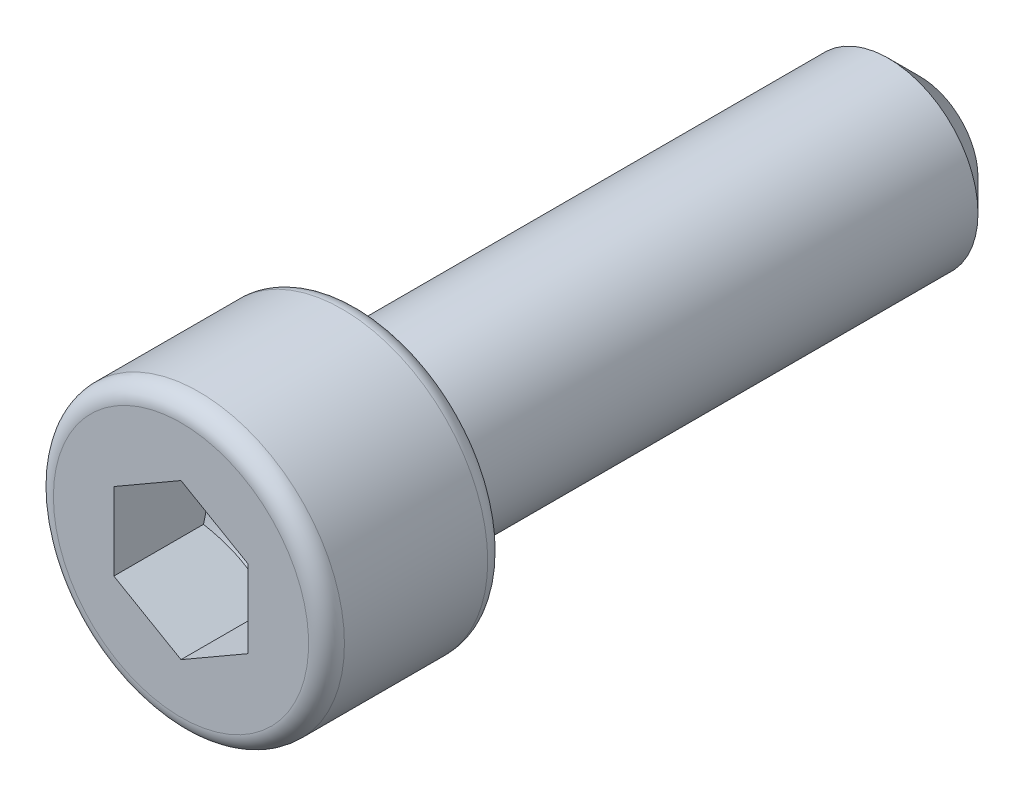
ISO-10303-21;
HEADER;
FILE_DESCRIPTION(('STEP AP214'),'2;1');
FILE_NAME('part.step','',(''),(''),'','','');
FILE_SCHEMA(('AUTOMOTIVE_DESIGN { 1 0 10303 214 1 1 1 1 }'));
ENDSEC;
DATA;
#1=APPLICATION_CONTEXT('core data for automotive mechanical design processes');
#2=APPLICATION_PROTOCOL_DEFINITION('international standard','automotive_design',2000,#1);
#3=PRODUCT_CONTEXT('',#1,'mechanical');
#4=PRODUCT('Part','Part','',(#3));
#5=PRODUCT_RELATED_PRODUCT_CATEGORY('part','',(#4));
#6=PRODUCT_DEFINITION_FORMATION('','',#4);
#7=PRODUCT_DEFINITION_CONTEXT('part definition',#1,'design');
#8=PRODUCT_DEFINITION('design','',#6,#7);
#9=PRODUCT_DEFINITION_SHAPE('','',#8);
#10=(LENGTH_UNIT() NAMED_UNIT(*) SI_UNIT(.MILLI.,.METRE.));
#11=(NAMED_UNIT(*) PLANE_ANGLE_UNIT() SI_UNIT($,.RADIAN.));
#12=(NAMED_UNIT(*) SI_UNIT($,.STERADIAN.) SOLID_ANGLE_UNIT());
#13=UNCERTAINTY_MEASURE_WITH_UNIT(LENGTH_MEASURE(1.E-05),#10,'distance_accuracy_value','');
#14=(GEOMETRIC_REPRESENTATION_CONTEXT(3) GLOBAL_UNCERTAINTY_ASSIGNED_CONTEXT((#13)) GLOBAL_UNIT_ASSIGNED_CONTEXT((#10,
#11,#12)) REPRESENTATION_CONTEXT('',''));
#15=CARTESIAN_POINT('',(0.,0.,0.));
#16=DIRECTION('',(0.,0.,1.));
#17=DIRECTION('',(1.,0.,0.));
#18=AXIS2_PLACEMENT_3D('',#15,#16,#17);
#19=CARTESIAN_POINT('',(3.,1.73205080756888,-4.));
#20=DIRECTION('',(0.5,0.866025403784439,0.));
#21=DIRECTION('',(-0.866025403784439,0.5,0.));
#22=AXIS2_PLACEMENT_3D('',#19,#20,#21);
#23=PLANE('',#22);
#24=CARTESIAN_POINT('',(3.0002,1.73193533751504,-4.00166444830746));
#25=CARTESIAN_POINT('',(2.86836479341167,1.80805042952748,-4.04562660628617));
#26=CARTESIAN_POINT('',(2.73539159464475,1.88482254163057,-4.08560872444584));
#27=CARTESIAN_POINT('',(2.46714257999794,2.03969618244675,-4.15539823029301));
#28=CARTESIAN_POINT('',(2.33186199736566,2.11780046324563,-4.18518092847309));
#29=CARTESIAN_POINT('',(2.06297739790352,2.27304105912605,-4.23154247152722));
#30=CARTESIAN_POINT('',(1.92941475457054,2.35015348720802,-4.24842986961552));
#31=CARTESIAN_POINT('',(1.66166094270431,2.50474122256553,-4.26859066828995));
#32=CARTESIAN_POINT('',(1.52747074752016,2.58221596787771,-4.27188076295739));
#33=CARTESIAN_POINT('',(1.27672440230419,2.72698443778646,-4.26503977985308));
#34=CARTESIAN_POINT('',(1.16013073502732,2.79429982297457,-4.25658839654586));
#35=CARTESIAN_POINT('',(0.927703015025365,2.92849202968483,-4.22980136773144));
#36=CARTESIAN_POINT('',(0.81186976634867,2.99536838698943,-4.21145656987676));
#37=CARTESIAN_POINT('',(0.578962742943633,3.12983731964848,-4.16559555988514));
#38=CARTESIAN_POINT('',(0.46191844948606,3.19741287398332,-4.13788492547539));
#39=CARTESIAN_POINT('',(0.229575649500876,3.33155605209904,-4.07499251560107));
#40=CARTESIAN_POINT('',(0.114274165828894,3.39812539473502,-4.03982551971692));
#41=CARTESIAN_POINT('',(-0.000199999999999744,3.46421708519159,-4.00166444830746));
#42=B_SPLINE_CURVE_WITH_KNOTS('',3,(#24,#25,#26,#27,#28,#29,#30,#31,#32,#33,#34,#35,#36,#37,#38,
#39,#40,#41),.UNSPECIFIED.,.F.,.F.,(4,2,2,2,2,2,2,2,4),(0.,0.475539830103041,0.952222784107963,
1.41710776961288,1.88142182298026,2.28572436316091,2.69040156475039,3.10405572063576,
3.5168974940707),.UNSPECIFIED.);
#43=CARTESIAN_POINT('',(3.,1.73205080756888,-4.00173111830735));
#44=VERTEX_POINT('',#43);
#45=CARTESIAN_POINT('',(0.,3.46410161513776,-4.00173111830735));
#46=VERTEX_POINT('',#45);
#47=EDGE_CURVE('E102',#44,#46,#42,.T.);
#48=ORIENTED_EDGE('',*,*,#47,.F.);
#49=DIRECTION('',(0.,0.,1.));
#50=VECTOR('',#49,1.);
#51=CARTESIAN_POINT('',(3.,1.73205080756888,-4.));
#52=LINE('',#51,#50);
#53=CARTESIAN_POINT('',(3.,1.73205080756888,0.));
#54=VERTEX_POINT('',#53);
#55=EDGE_CURVE('E267',#44,#54,#52,.T.);
#56=ORIENTED_EDGE('',*,*,#55,.T.);
#57=DIRECTION('',(-0.866025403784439,0.5,0.));
#58=VECTOR('',#57,1.);
#59=CARTESIAN_POINT('',(3.,1.73205080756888,0.));
#60=LINE('',#59,#58);
#61=CARTESIAN_POINT('',(0.,3.46410161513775,0.));
#62=VERTEX_POINT('',#61);
#63=EDGE_CURVE('E153',#54,#62,#60,.T.);
#64=ORIENTED_EDGE('',*,*,#63,.T.);
#65=DIRECTION('',(0.,0.,1.));
#66=VECTOR('',#65,1.);
#67=CARTESIAN_POINT('',(0.,3.46410161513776,-4.));
#68=LINE('',#67,#66);
#69=EDGE_CURVE('E273',#46,#62,#68,.T.);
#70=ORIENTED_EDGE('',*,*,#69,.F.);
#71=EDGE_LOOP('',(#48,#56,#64,#70));
#72=FACE_BOUND('',#71,.T.);
#73=ADVANCED_FACE('F87',(#72),#23,.F.);
#74=CARTESIAN_POINT('',(3.,-1.73205080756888,-4.));
#75=DIRECTION('',(1.,0.,0.));
#76=DIRECTION('',(0.,0.,-1.));
#77=AXIS2_PLACEMENT_3D('',#74,#75,#76);
#78=PLANE('',#77);
#79=CARTESIAN_POINT('',(3.,-4.48620013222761,-2.88585822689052));
#80=CARTESIAN_POINT('',(3.,-4.3566315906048,-2.94802358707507));
#81=CARTESIAN_POINT('',(3.,-4.22674746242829,-3.00954343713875));
#82=CARTESIAN_POINT('',(3.,-3.96617981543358,-3.13092589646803));
#83=CARTESIAN_POINT('',(3.,-3.83549615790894,-3.19078820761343));
#84=CARTESIAN_POINT('',(3.,-3.57241191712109,-3.30882380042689));
#85=CARTESIAN_POINT('',(3.,-3.44000572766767,-3.36698463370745));
#86=CARTESIAN_POINT('',(3.,-3.17408239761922,-3.48069891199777));
#87=CARTESIAN_POINT('',(3.,-3.04056531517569,-3.53625249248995));
#88=CARTESIAN_POINT('',(3.,-2.76868835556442,-3.64547348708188));
#89=CARTESIAN_POINT('',(3.,-2.63029316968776,-3.69905352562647));
#90=CARTESIAN_POINT('',(3.,-2.35182880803,-3.8017598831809));
#91=CARTESIAN_POINT('',(3.,-2.2117594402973,-3.85088568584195));
#92=CARTESIAN_POINT('',(3.,-1.93004107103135,-3.94328082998));
#93=CARTESIAN_POINT('',(3.,-1.78839647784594,-3.98656346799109));
#94=CARTESIAN_POINT('',(3.,-1.50308947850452,-4.06578585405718));
#95=CARTESIAN_POINT('',(3.,-1.35942776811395,-4.10172807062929));
#96=CARTESIAN_POINT('',(3.,-1.07038630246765,-4.16435557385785));
#97=CARTESIAN_POINT('',(3.,-0.925010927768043,-4.19106068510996));
#98=CARTESIAN_POINT('',(3.,-0.632633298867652,-4.2334698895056));
#99=CARTESIAN_POINT('',(3.,-0.485631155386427,-4.24917472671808));
#100=CARTESIAN_POINT('',(3.,-0.192575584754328,-4.26812625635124));
#101=CARTESIAN_POINT('',(3.,-0.046531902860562,-4.27152000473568));
#102=CARTESIAN_POINT('',(3.,0.245327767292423,-4.26593974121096));
#103=CARTESIAN_POINT('',(3.,0.391143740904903,-4.2569649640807));
#104=CARTESIAN_POINT('',(3.,0.643627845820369,-4.23132100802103));
#105=CARTESIAN_POINT('',(3.,0.750575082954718,-4.21727322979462));
#106=CARTESIAN_POINT('',(3.,0.963574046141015,-4.18349060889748));
#107=CARTESIAN_POINT('',(3.,1.06962562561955,-4.1637548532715));
#108=CARTESIAN_POINT('',(3.,1.38635461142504,-4.0970655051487));
#109=CARTESIAN_POINT('',(3.,1.59547137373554,-4.04264522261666));
#110=CARTESIAN_POINT('',(3.,1.90813887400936,-3.94967638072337));
#111=CARTESIAN_POINT('',(3.,2.01333803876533,-3.91636793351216));
#112=CARTESIAN_POINT('',(3.,2.22271330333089,-3.84664892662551));
#113=CARTESIAN_POINT('',(3.,2.32688939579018,-3.81023834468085));
#114=CARTESIAN_POINT('',(3.,2.53426014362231,-3.73486938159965));
#115=CARTESIAN_POINT('',(3.,2.63745517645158,-3.69591202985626));
#116=CARTESIAN_POINT('',(3.,2.84301340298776,-3.61587190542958));
#117=CARTESIAN_POINT('',(3.,2.94537661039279,-3.57478916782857));
#118=CARTESIAN_POINT('',(3.,3.20670848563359,-3.46727166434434));
#119=CARTESIAN_POINT('',(3.,3.36515381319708,-3.39956650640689));
#120=CARTESIAN_POINT('',(3.,3.68061655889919,-3.26089781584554));
#121=CARTESIAN_POINT('',(3.,3.83763386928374,-3.18993403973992));
#122=CARTESIAN_POINT('',(3.,4.15054605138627,-3.04548351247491));
#123=CARTESIAN_POINT('',(3.,4.30644064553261,-2.97199616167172));
#124=CARTESIAN_POINT('',(3.,4.6172907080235,-2.8230583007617));
#125=CARTESIAN_POINT('',(3.,4.77224615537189,-2.74760774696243));
#126=CARTESIAN_POINT('',(3.,5.23633561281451,-2.51876716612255));
#127=CARTESIAN_POINT('',(3.,5.54432599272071,-2.36306005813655));
#128=CARTESIAN_POINT('',(3.,6.15819238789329,-2.04766581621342));
#129=CARTESIAN_POINT('',(3.,6.46406870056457,-1.88797925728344));
#130=CARTESIAN_POINT('',(3.,7.04555187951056,-1.58104870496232));
#131=CARTESIAN_POINT('',(3.,7.32129017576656,-1.43405330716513));
#132=CARTESIAN_POINT('',(3.,7.87188136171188,-1.13838810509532));
#133=CARTESIAN_POINT('',(3.,8.14673421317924,-0.989718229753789));
#134=CARTESIAN_POINT('',(3.,8.69505790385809,-0.691503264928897));
#135=CARTESIAN_POINT('',(3.,8.96853048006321,-0.541961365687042));
#136=CARTESIAN_POINT('',(3.,9.51492125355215,-0.241905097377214));
#137=CARTESIAN_POINT('',(3.,9.78783948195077,-0.0913907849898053));
#138=CARTESIAN_POINT('',(3.,10.0605590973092,0.0594802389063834));
#139=B_SPLINE_CURVE_WITH_KNOTS('',3,(#79,#80,#81,#82,#83,#84,#85,#86,#87,#88,#89,#90,#91,#92,
#93,#94,#95,#96,#97,#98,#99,#100,#101,#102,#103,#104,#105,#106,#107,#108,#109,#110,#111,#112,
#113,#114,#115,#116,#117,#118,#119,#120,#121,#122,#123,#124,#125,#126,#127,#128,#129,#130,#131,
#132,#133,#134,#135,#136,#137,#138),.UNSPECIFIED.,.F.,.F.,(4,2,2,2,2,2,2,2,2,2,2,2,2,2,2,2,2,2,
2,2,2,2,2,2,2,2,2,2,2,4),(0.,0.431135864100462,0.86234877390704,1.29617742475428,
1.72998350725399,2.17513936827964,2.62034676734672,3.06452334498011,3.50855030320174,
3.95161829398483,4.39465631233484,4.83238448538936,5.27013974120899,5.59357754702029,
5.9170672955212,6.56445229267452,6.89546799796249,7.22648607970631,7.55737118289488,
7.88825082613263,8.40511202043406,8.92201189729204,9.43903545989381,9.95607053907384,
10.99135546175,12.0264916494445,12.9639022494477,13.901352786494,14.8364175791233,
15.7714283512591),.UNSPECIFIED.);
#140=CARTESIAN_POINT('',(3.,-1.73205080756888,-4.00173111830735));
#141=VERTEX_POINT('',#140);
#142=EDGE_CURVE('E109',#141,#44,#139,.T.);
#143=ORIENTED_EDGE('',*,*,#142,.F.);
#144=DIRECTION('',(0.,0.,1.));
#145=VECTOR('',#144,1.);
#146=CARTESIAN_POINT('',(3.,-1.73205080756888,-4.));
#147=LINE('',#146,#145);
#148=CARTESIAN_POINT('',(3.,-1.73205080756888,0.));
#149=VERTEX_POINT('',#148);
#150=EDGE_CURVE('E270',#141,#149,#147,.T.);
#151=ORIENTED_EDGE('',*,*,#150,.T.);
#152=DIRECTION('',(0.,1.,0.));
#153=VECTOR('',#152,1.);
#154=CARTESIAN_POINT('',(3.,-1.73205080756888,0.));
#155=LINE('',#154,#153);
#156=EDGE_CURVE('E276',#149,#54,#155,.T.);
#157=ORIENTED_EDGE('',*,*,#156,.T.);
#158=ORIENTED_EDGE('',*,*,#55,.F.);
#159=EDGE_LOOP('',(#143,#151,#157,#158));
#160=FACE_BOUND('',#159,.T.);
#161=ADVANCED_FACE('F174',(#160),#78,.F.);
#162=CARTESIAN_POINT('',(0.,-3.46410161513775,-4.));
#163=DIRECTION('',(0.5,-0.866025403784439,0.));
#164=DIRECTION('',(0.866025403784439,0.5,0.));
#165=AXIS2_PLACEMENT_3D('',#162,#163,#164);
#166=PLANE('',#165);
#167=CARTESIAN_POINT('',(-0.000200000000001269,-3.46421708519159,-4.00166444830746));
#168=CARTESIAN_POINT('',(0.131635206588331,-3.38810199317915,-4.04562660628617));
#169=CARTESIAN_POINT('',(0.264608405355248,-3.31132988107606,-4.08560872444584));
#170=CARTESIAN_POINT('',(0.532857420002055,-3.15645624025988,-4.15539823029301));
#171=CARTESIAN_POINT('',(0.668138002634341,-3.078351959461,-4.18518092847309));
#172=CARTESIAN_POINT('',(0.937022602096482,-2.92311136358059,-4.23154247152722));
#173=CARTESIAN_POINT('',(1.07058524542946,-2.84599893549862,-4.24842986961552));
#174=CARTESIAN_POINT('',(1.33833905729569,-2.6914112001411,-4.26859066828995));
#175=CARTESIAN_POINT('',(1.47252925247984,-2.61393645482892,-4.27188076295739));
#176=CARTESIAN_POINT('',(1.72327559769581,-2.46916798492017,-4.26503977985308));
#177=CARTESIAN_POINT('',(1.83986926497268,-2.40185259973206,-4.25658839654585));
#178=CARTESIAN_POINT('',(2.07229698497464,-2.2676603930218,-4.22980136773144));
#179=CARTESIAN_POINT('',(2.18813023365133,-2.2007840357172,-4.21145656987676));
#180=CARTESIAN_POINT('',(2.42103725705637,-2.06631510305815,-4.16559555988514));
#181=CARTESIAN_POINT('',(2.53808155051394,-1.99873954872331,-4.13788492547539));
#182=CARTESIAN_POINT('',(2.77042435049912,-1.86459637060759,-4.07499251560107));
#183=CARTESIAN_POINT('',(2.88572583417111,-1.79802702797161,-4.03982551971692));
#184=CARTESIAN_POINT('',(3.0002,-1.73193533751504,-4.00166444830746));
#185=B_SPLINE_CURVE_WITH_KNOTS('',3,(#167,#168,#169,#170,#171,#172,#173,#174,#175,#176,#177,
#178,#179,#180,#181,#182,#183,#184),.UNSPECIFIED.,.F.,.F.,(4,2,2,2,2,2,2,2,4),(0.,
0.475539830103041,0.952222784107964,1.41710776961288,1.88142182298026,2.28572436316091,
2.69040156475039,3.10405572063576,3.5168974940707),.UNSPECIFIED.);
#186=CARTESIAN_POINT('',(0.,-3.46410161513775,-4.00173111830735));
#187=VERTEX_POINT('',#186);
#188=EDGE_CURVE('E151',#187,#141,#185,.T.);
#189=ORIENTED_EDGE('',*,*,#188,.F.);
#190=DIRECTION('',(0.,0.,1.));
#191=VECTOR('',#190,1.);
#192=CARTESIAN_POINT('',(0.,-3.46410161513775,-4.));
#193=LINE('',#192,#191);
#194=CARTESIAN_POINT('',(0.,-3.46410161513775,0.));
#195=VERTEX_POINT('',#194);
#196=EDGE_CURVE('E280',#187,#195,#193,.T.);
#197=ORIENTED_EDGE('',*,*,#196,.T.);
#198=DIRECTION('',(0.866025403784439,0.5,0.));
#199=VECTOR('',#198,1.);
#200=CARTESIAN_POINT('',(0.,-3.46410161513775,0.));
#201=LINE('',#200,#199);
#202=EDGE_CURVE('E285',#195,#149,#201,.T.);
#203=ORIENTED_EDGE('',*,*,#202,.T.);
#204=ORIENTED_EDGE('',*,*,#150,.F.);
#205=EDGE_LOOP('',(#189,#197,#203,#204));
#206=FACE_BOUND('',#205,.T.);
#207=ADVANCED_FACE('F207',(#206),#166,.F.);
#208=CARTESIAN_POINT('',(-3.,-1.73205080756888,-4.));
#209=DIRECTION('',(-0.5,-0.866025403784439,0.));
#210=DIRECTION('',(0.866025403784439,-0.5,0.));
#211=AXIS2_PLACEMENT_3D('',#208,#209,#210);
#212=PLANE('',#211);
#213=CARTESIAN_POINT('',(-3.0002,-1.73193533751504,-4.00166444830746));
#214=CARTESIAN_POINT('',(-2.86836479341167,-1.80805042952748,-4.04562660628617));
#215=CARTESIAN_POINT('',(-2.73539159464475,-1.88482254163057,-4.08560872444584));
#216=CARTESIAN_POINT('',(-2.46714257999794,-2.03969618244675,-4.15539823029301));
#217=CARTESIAN_POINT('',(-2.33186199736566,-2.11780046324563,-4.18518092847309));
#218=CARTESIAN_POINT('',(-2.06297739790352,-2.27304105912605,-4.23154247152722));
#219=CARTESIAN_POINT('',(-1.92941475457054,-2.35015348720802,-4.24842986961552));
#220=CARTESIAN_POINT('',(-1.66166094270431,-2.50474122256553,-4.26859066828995));
#221=CARTESIAN_POINT('',(-1.52747074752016,-2.58221596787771,-4.27188076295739));
#222=CARTESIAN_POINT('',(-1.27672440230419,-2.72698443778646,-4.26503977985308));
#223=CARTESIAN_POINT('',(-1.16013073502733,-2.79429982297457,-4.25658839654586));
#224=CARTESIAN_POINT('',(-0.927703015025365,-2.92849202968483,-4.22980136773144));
#225=CARTESIAN_POINT('',(-0.81186976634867,-2.99536838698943,-4.21145656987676));
#226=CARTESIAN_POINT('',(-0.578962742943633,-3.12983731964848,-4.16559555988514));
#227=CARTESIAN_POINT('',(-0.46191844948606,-3.19741287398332,-4.13788492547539));
#228=CARTESIAN_POINT('',(-0.229575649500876,-3.33155605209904,-4.07499251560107));
#229=CARTESIAN_POINT('',(-0.114274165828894,-3.39812539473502,-4.03982551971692));
#230=CARTESIAN_POINT('',(0.000199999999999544,-3.46421708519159,-4.00166444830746));
#231=B_SPLINE_CURVE_WITH_KNOTS('',3,(#213,#214,#215,#216,#217,#218,#219,#220,#221,#222,#223,
#224,#225,#226,#227,#228,#229,#230),.UNSPECIFIED.,.F.,.F.,(4,2,2,2,2,2,2,2,4),(0.,
0.475539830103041,0.952222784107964,1.41710776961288,1.88142182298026,2.28572436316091,
2.69040156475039,3.10405572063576,3.5168974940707),.UNSPECIFIED.);
#232=CARTESIAN_POINT('',(-3.,-1.73205080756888,-4.00173111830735));
#233=VERTEX_POINT('',#232);
#234=EDGE_CURVE('E155',#233,#187,#231,.T.);
#235=ORIENTED_EDGE('',*,*,#234,.F.);
#236=DIRECTION('',(0.,0.,1.));
#237=VECTOR('',#236,1.);
#238=CARTESIAN_POINT('',(-3.,-1.73205080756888,-4.));
#239=LINE('',#238,#237);
#240=CARTESIAN_POINT('',(-3.,-1.73205080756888,0.));
#241=VERTEX_POINT('',#240);
#242=EDGE_CURVE('E278',#233,#241,#239,.T.);
#243=ORIENTED_EDGE('',*,*,#242,.T.);
#244=DIRECTION('',(0.866025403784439,-0.5,0.));
#245=VECTOR('',#244,1.);
#246=CARTESIAN_POINT('',(-3.,-1.73205080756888,0.));
#247=LINE('',#246,#245);
#248=EDGE_CURVE('E288',#241,#195,#247,.T.);
#249=ORIENTED_EDGE('',*,*,#248,.T.);
#250=ORIENTED_EDGE('',*,*,#196,.F.);
#251=EDGE_LOOP('',(#235,#243,#249,#250));
#252=FACE_BOUND('',#251,.T.);
#253=ADVANCED_FACE('F203',(#252),#212,.F.);
#254=CARTESIAN_POINT('',(-3.,1.73205080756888,-4.));
#255=DIRECTION('',(-1.,0.,0.));
#256=DIRECTION('',(0.,0.,1.));
#257=AXIS2_PLACEMENT_3D('',#254,#255,#256);
#258=PLANE('',#257);
#259=CARTESIAN_POINT('',(-3.,-4.48620013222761,-2.88585822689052));
#260=CARTESIAN_POINT('',(-3.,-4.35663159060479,-2.94802358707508));
#261=CARTESIAN_POINT('',(-3.,-4.22674746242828,-3.00954343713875));
#262=CARTESIAN_POINT('',(-3.,-3.96617981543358,-3.13092589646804));
#263=CARTESIAN_POINT('',(-3.,-3.83549615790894,-3.19078820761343));
#264=CARTESIAN_POINT('',(-3.,-3.57241191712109,-3.30882380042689));
#265=CARTESIAN_POINT('',(-3.,-3.44000572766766,-3.36698463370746));
#266=CARTESIAN_POINT('',(-3.,-3.17408239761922,-3.48069891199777));
#267=CARTESIAN_POINT('',(-3.,-3.04056531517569,-3.53625249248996));
#268=CARTESIAN_POINT('',(-3.,-2.76868835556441,-3.64547348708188));
#269=CARTESIAN_POINT('',(-3.,-2.63029316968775,-3.69905352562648));
#270=CARTESIAN_POINT('',(-3.,-2.35182880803,-3.8017598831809));
#271=CARTESIAN_POINT('',(-3.,-2.2117594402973,-3.85088568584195));
#272=CARTESIAN_POINT('',(-3.,-1.93004107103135,-3.94328082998));
#273=CARTESIAN_POINT('',(-3.,-1.78839647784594,-3.98656346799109));
#274=CARTESIAN_POINT('',(-3.,-1.50308947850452,-4.06578585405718));
#275=CARTESIAN_POINT('',(-3.,-1.35942776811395,-4.10172807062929));
#276=CARTESIAN_POINT('',(-3.,-1.07038630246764,-4.16435557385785));
#277=CARTESIAN_POINT('',(-3.,-0.925010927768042,-4.19106068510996));
#278=CARTESIAN_POINT('',(-3.,-0.632633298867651,-4.2334698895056));
#279=CARTESIAN_POINT('',(-3.,-0.485631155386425,-4.24917472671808));
#280=CARTESIAN_POINT('',(-3.,-0.192575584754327,-4.26812625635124));
#281=CARTESIAN_POINT('',(-3.,-0.0465319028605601,-4.27152000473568));
#282=CARTESIAN_POINT('',(-3.,0.245327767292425,-4.26593974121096));
#283=CARTESIAN_POINT('',(-3.,0.391143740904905,-4.2569649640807));
#284=CARTESIAN_POINT('',(-3.,0.64362784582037,-4.23132100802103));
#285=CARTESIAN_POINT('',(-3.,0.75057508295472,-4.21727322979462));
#286=CARTESIAN_POINT('',(-3.,0.963574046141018,-4.18349060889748));
#287=CARTESIAN_POINT('',(-3.,1.06962562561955,-4.1637548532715));
#288=CARTESIAN_POINT('',(-3.,1.38635461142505,-4.0970655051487));
#289=CARTESIAN_POINT('',(-3.,1.59547137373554,-4.04264522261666));
#290=CARTESIAN_POINT('',(-3.,1.90813887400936,-3.94967638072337));
#291=CARTESIAN_POINT('',(-3.,2.01333803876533,-3.91636793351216));
#292=CARTESIAN_POINT('',(-3.,2.22271330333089,-3.84664892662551));
#293=CARTESIAN_POINT('',(-3.,2.32688939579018,-3.81023834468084));
#294=CARTESIAN_POINT('',(-3.,2.53426014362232,-3.73486938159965));
#295=CARTESIAN_POINT('',(-3.,2.63745517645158,-3.69591202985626));
#296=CARTESIAN_POINT('',(-3.,2.84301340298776,-3.61587190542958));
#297=CARTESIAN_POINT('',(-3.,2.94537661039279,-3.57478916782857));
#298=CARTESIAN_POINT('',(-3.,3.20670848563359,-3.46727166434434));
#299=CARTESIAN_POINT('',(-3.,3.36515381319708,-3.39956650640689));
#300=CARTESIAN_POINT('',(-3.,3.68061655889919,-3.26089781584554));
#301=CARTESIAN_POINT('',(-3.,3.83763386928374,-3.18993403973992));
#302=CARTESIAN_POINT('',(-3.,4.15054605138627,-3.04548351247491));
#303=CARTESIAN_POINT('',(-3.,4.30644064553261,-2.97199616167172));
#304=CARTESIAN_POINT('',(-3.,4.61729070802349,-2.8230583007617));
#305=CARTESIAN_POINT('',(-3.,4.77224615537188,-2.74760774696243));
#306=CARTESIAN_POINT('',(-3.,5.23633561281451,-2.51876716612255));
#307=CARTESIAN_POINT('',(-3.,5.54432599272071,-2.36306005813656));
#308=CARTESIAN_POINT('',(-3.,6.15819238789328,-2.04766581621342));
#309=CARTESIAN_POINT('',(-3.,6.46406870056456,-1.88797925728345));
#310=CARTESIAN_POINT('',(-3.,7.04555187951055,-1.58104870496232));
#311=CARTESIAN_POINT('',(-3.,7.32129017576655,-1.43405330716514));
#312=CARTESIAN_POINT('',(-3.,7.87188136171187,-1.13838810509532));
#313=CARTESIAN_POINT('',(-3.,8.14673421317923,-0.989718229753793));
#314=CARTESIAN_POINT('',(-3.,8.69505790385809,-0.6915032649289));
#315=CARTESIAN_POINT('',(-3.,8.9685304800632,-0.541961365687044));
#316=CARTESIAN_POINT('',(-3.,9.51492125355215,-0.241905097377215));
#317=CARTESIAN_POINT('',(-3.,9.78783948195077,-0.0913907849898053));
#318=CARTESIAN_POINT('',(-3.,10.0605590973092,0.0594802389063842));
#319=B_SPLINE_CURVE_WITH_KNOTS('',3,(#259,#260,#261,#262,#263,#264,#265,#266,#267,#268,#269,
#270,#271,#272,#273,#274,#275,#276,#277,#278,#279,#280,#281,#282,#283,#284,#285,#286,#287,#288,
#289,#290,#291,#292,#293,#294,#295,#296,#297,#298,#299,#300,#301,#302,#303,#304,#305,#306,#307,
#308,#309,#310,#311,#312,#313,#314,#315,#316,#317,#318),.UNSPECIFIED.,.F.,.F.,(4,2,2,2,2,2,2,2,
2,2,2,2,2,2,2,2,2,2,2,2,2,2,2,2,2,2,2,2,2,4),(0.,0.431135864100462,0.86234877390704,
1.29617742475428,1.72998350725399,2.17513936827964,2.62034676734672,3.06452334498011,
3.50855030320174,3.95161829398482,4.39465631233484,4.83238448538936,5.27013974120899,
5.59357754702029,5.9170672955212,6.56445229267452,6.89546799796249,7.22648607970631,
7.55737118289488,7.88825082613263,8.40511202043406,8.92201189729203,9.43903545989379,
9.95607053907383,10.99135546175,12.0264916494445,12.9639022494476,13.901352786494,
14.8364175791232,15.7714283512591),.UNSPECIFIED.);
#320=CARTESIAN_POINT('',(-3.,1.73205080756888,-4.00173111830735));
#321=VERTEX_POINT('',#320);
#322=EDGE_CURVE('E191',#321,#233,#319,.F.);
#323=ORIENTED_EDGE('',*,*,#322,.F.);
#324=DIRECTION('',(0.,0.,1.));
#325=VECTOR('',#324,1.);
#326=CARTESIAN_POINT('',(-3.,1.73205080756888,-4.));
#327=LINE('',#326,#325);
#328=CARTESIAN_POINT('',(-3.,1.73205080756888,0.));
#329=VERTEX_POINT('',#328);
#330=EDGE_CURVE('E275',#321,#329,#327,.T.);
#331=ORIENTED_EDGE('',*,*,#330,.T.);
#332=DIRECTION('',(0.,-1.,0.));
#333=VECTOR('',#332,1.);
#334=CARTESIAN_POINT('',(-3.,1.73205080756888,0.));
#335=LINE('',#334,#333);
#336=EDGE_CURVE('E291',#329,#241,#335,.T.);
#337=ORIENTED_EDGE('',*,*,#336,.T.);
#338=ORIENTED_EDGE('',*,*,#242,.F.);
#339=EDGE_LOOP('',(#323,#331,#337,#338));
#340=FACE_BOUND('',#339,.T.);
#341=ADVANCED_FACE('F206',(#340),#258,.F.);
#342=CARTESIAN_POINT('',(0.,3.46410161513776,-4.));
#343=DIRECTION('',(-0.5,0.866025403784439,0.));
#344=DIRECTION('',(-0.866025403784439,-0.5,0.));
#345=AXIS2_PLACEMENT_3D('',#342,#343,#344);
#346=PLANE('',#345);
#347=CARTESIAN_POINT('',(0.000200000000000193,3.46421708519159,-4.00166444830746));
#348=CARTESIAN_POINT('',(-0.131635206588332,3.38810199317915,-4.04562660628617));
#349=CARTESIAN_POINT('',(-0.264608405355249,3.31132988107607,-4.08560872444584));
#350=CARTESIAN_POINT('',(-0.532857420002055,3.15645624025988,-4.15539823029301));
#351=CARTESIAN_POINT('',(-0.668138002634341,3.078351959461,-4.18518092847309));
#352=CARTESIAN_POINT('',(-0.937022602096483,2.92311136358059,-4.23154247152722));
#353=CARTESIAN_POINT('',(-1.07058524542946,2.84599893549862,-4.24842986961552));
#354=CARTESIAN_POINT('',(-1.33833905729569,2.6914112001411,-4.26859066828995));
#355=CARTESIAN_POINT('',(-1.47252925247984,2.61393645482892,-4.27188076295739));
#356=CARTESIAN_POINT('',(-1.72327559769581,2.46916798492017,-4.26503977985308));
#357=CARTESIAN_POINT('',(-1.83986926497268,2.40185259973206,-4.25658839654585));
#358=CARTESIAN_POINT('',(-2.07229698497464,2.2676603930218,-4.22980136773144));
#359=CARTESIAN_POINT('',(-2.18813023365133,2.2007840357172,-4.21145656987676));
#360=CARTESIAN_POINT('',(-2.42103725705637,2.06631510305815,-4.16559555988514));
#361=CARTESIAN_POINT('',(-2.53808155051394,1.99873954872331,-4.13788492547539));
#362=CARTESIAN_POINT('',(-2.77042435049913,1.86459637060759,-4.07499251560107));
#363=CARTESIAN_POINT('',(-2.88572583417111,1.79802702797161,-4.03982551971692));
#364=CARTESIAN_POINT('',(-3.0002,1.73193533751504,-4.00166444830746));
#365=B_SPLINE_CURVE_WITH_KNOTS('',3,(#347,#348,#349,#350,#351,#352,#353,#354,#355,#356,#357,
#358,#359,#360,#361,#362,#363,#364),.UNSPECIFIED.,.F.,.F.,(4,2,2,2,2,2,2,2,4),(0.,
0.47553983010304,0.952222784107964,1.41710776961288,1.88142182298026,2.28572436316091,
2.69040156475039,3.10405572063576,3.5168974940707),.UNSPECIFIED.);
#366=EDGE_CURVE('E180',#46,#321,#365,.T.);
#367=ORIENTED_EDGE('',*,*,#366,.F.);
#368=ORIENTED_EDGE('',*,*,#69,.T.);
#369=DIRECTION('',(-0.866025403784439,-0.5,0.));
#370=VECTOR('',#369,1.);
#371=CARTESIAN_POINT('',(0.,3.46410161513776,0.));
#372=LINE('',#371,#370);
#373=EDGE_CURVE('E294',#62,#329,#372,.T.);
#374=ORIENTED_EDGE('',*,*,#373,.T.);
#375=ORIENTED_EDGE('',*,*,#330,.F.);
#376=EDGE_LOOP('',(#367,#368,#374,#375));
#377=FACE_BOUND('',#376,.T.);
#378=ADVANCED_FACE('F212',(#377),#346,.F.);
#379=CARTESIAN_POINT('',(0.,0.,0.));
#380=DIRECTION('',(0.,0.,-1.));
#381=DIRECTION('',(-1.,0.,0.));
#382=AXIS2_PLACEMENT_3D('',#379,#380,#381);
#383=PLANE('',#382);
#384=CARTESIAN_POINT('',(0.,0.,0.));
#385=DIRECTION('',(0.,0.,-1.));
#386=DIRECTION('',(-1.,0.,0.));
#387=AXIS2_PLACEMENT_3D('',#384,#385,#386);
#388=CIRCLE('',#387,5.7);
#389=CARTESIAN_POINT('',(-5.7,0.,0.));
#390=VERTEX_POINT('',#389);
#391=EDGE_CURVE('E254',#390,#390,#388,.F.);
#392=ORIENTED_EDGE('',*,*,#391,.T.);
#393=EDGE_LOOP('',(#392));
#394=FACE_BOUND('',#393,.T.);
#395=ORIENTED_EDGE('',*,*,#373,.F.);
#396=ORIENTED_EDGE('',*,*,#63,.F.);
#397=ORIENTED_EDGE('',*,*,#156,.F.);
#398=ORIENTED_EDGE('',*,*,#202,.F.);
#399=ORIENTED_EDGE('',*,*,#248,.F.);
#400=ORIENTED_EDGE('',*,*,#336,.F.);
#401=EDGE_LOOP('',(#395,#396,#397,#398,#399,#400));
#402=FACE_BOUND('',#401,.T.);
#403=ADVANCED_FACE('F216',(#394,#402),#383,.F.);
#404=CARTESIAN_POINT('',(0.,0.,0.));
#405=DIRECTION('',(0.,0.,1.));
#406=DIRECTION('',(1.,0.,0.));
#407=AXIS2_PLACEMENT_3D('',#404,#405,#406);
#408=CYLINDRICAL_SURFACE('',#407,6.5);
#409=CARTESIAN_POINT('',(0.,0.,-7.2));
#410=DIRECTION('',(0.,0.,1.));
#411=DIRECTION('',(1.,0.,0.));
#412=AXIS2_PLACEMENT_3D('',#409,#410,#411);
#413=CIRCLE('',#412,6.5);
#414=CARTESIAN_POINT('',(6.5,0.,-7.2));
#415=VERTEX_POINT('',#414);
#416=EDGE_CURVE('E259',#415,#415,#413,.T.);
#417=ORIENTED_EDGE('',*,*,#416,.T.);
#418=EDGE_LOOP('',(#417));
#419=FACE_BOUND('',#418,.T.);
#420=CARTESIAN_POINT('',(0.,0.,-0.8));
#421=DIRECTION('',(0.,0.,-1.));
#422=DIRECTION('',(-1.,0.,0.));
#423=AXIS2_PLACEMENT_3D('',#420,#421,#422);
#424=CIRCLE('',#423,6.5);
#425=CARTESIAN_POINT('',(-6.5,0.,-0.8));
#426=VERTEX_POINT('',#425);
#427=EDGE_CURVE('E251',#426,#426,#424,.T.);
#428=ORIENTED_EDGE('',*,*,#427,.T.);
#429=EDGE_LOOP('',(#428));
#430=FACE_BOUND('',#429,.T.);
#431=ADVANCED_FACE('F231',(#419,#430),#408,.T.);
#432=CARTESIAN_POINT('',(0.,6.5,-8.));
#433=DIRECTION('',(0.,0.,1.));
#434=DIRECTION('',(1.,0.,0.));
#435=AXIS2_PLACEMENT_3D('',#432,#433,#434);
#436=PLANE('',#435);
#437=CARTESIAN_POINT('',(0.,0.,-8.));
#438=DIRECTION('',(0.,0.,1.));
#439=DIRECTION('',(1.,0.,0.));
#440=AXIS2_PLACEMENT_3D('',#437,#438,#439);
#441=CIRCLE('',#440,5.7);
#442=CARTESIAN_POINT('',(5.7,0.,-8.));
#443=VERTEX_POINT('',#442);
#444=EDGE_CURVE('E255',#443,#443,#441,.F.);
#445=ORIENTED_EDGE('',*,*,#444,.T.);
#446=EDGE_LOOP('',(#445));
#447=FACE_BOUND('',#446,.T.);
#448=CARTESIAN_POINT('',(0.,0.,-8.));
#449=DIRECTION('',(0.,0.,1.));
#450=DIRECTION('',(1.,0.,0.));
#451=AXIS2_PLACEMENT_3D('',#448,#449,#450);
#452=CIRCLE('',#451,4.);
#453=CARTESIAN_POINT('',(4.,0.,-8.));
#454=VERTEX_POINT('',#453);
#455=EDGE_CURVE('E264',#454,#454,#452,.T.);
#456=ORIENTED_EDGE('',*,*,#455,.T.);
#457=EDGE_LOOP('',(#456));
#458=FACE_BOUND('',#457,.T.);
#459=ADVANCED_FACE('F227',(#447,#458),#436,.F.);
#460=CARTESIAN_POINT('',(0.,0.,0.));
#461=DIRECTION('',(0.,0.,1.));
#462=DIRECTION('',(1.,0.,0.));
#463=AXIS2_PLACEMENT_3D('',#460,#461,#462);
#464=CYLINDRICAL_SURFACE('',#463,4.);
#465=CARTESIAN_POINT('',(0.,0.,-31.6));
#466=DIRECTION('',(0.,0.,1.));
#467=DIRECTION('',(1.,0.,0.));
#468=AXIS2_PLACEMENT_3D('',#465,#466,#467);
#469=CIRCLE('',#468,4.);
#470=CARTESIAN_POINT('',(4.,0.,-31.6));
#471=VERTEX_POINT('',#470);
#472=EDGE_CURVE('E95',#471,#471,#469,.T.);
#473=ORIENTED_EDGE('',*,*,#472,.T.);
#474=EDGE_LOOP('',(#473));
#475=FACE_BOUND('',#474,.T.);
#476=ORIENTED_EDGE('',*,*,#455,.F.);
#477=EDGE_LOOP('',(#476));
#478=FACE_BOUND('',#477,.T.);
#479=ADVANCED_FACE('F223',(#475,#478),#464,.T.);
#480=CARTESIAN_POINT('',(0.,4.,-33.));
#481=DIRECTION('',(0.,0.,1.));
#482=DIRECTION('',(1.,0.,0.));
#483=AXIS2_PLACEMENT_3D('',#480,#481,#482);
#484=PLANE('',#483);
#485=CARTESIAN_POINT('',(0.,0.,-33.));
#486=DIRECTION('',(0.,0.,1.));
#487=DIRECTION('',(1.,0.,0.));
#488=AXIS2_PLACEMENT_3D('',#485,#486,#487);
#489=CIRCLE('',#488,2.6);
#490=CARTESIAN_POINT('',(2.59999999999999,0.,-33.));
#491=VERTEX_POINT('',#490);
#492=EDGE_CURVE('E46',#491,#491,#489,.F.);
#493=ORIENTED_EDGE('',*,*,#492,.T.);
#494=EDGE_LOOP('',(#493));
#495=FACE_BOUND('',#494,.T.);
#496=ADVANCED_FACE('F146',(#495),#484,.F.);
#497=CARTESIAN_POINT('',(0.,0.,-4.));
#498=DIRECTION('',(0.,0.,1.));
#499=DIRECTION('',(1.,0.,0.));
#500=AXIS2_PLACEMENT_3D('',#497,#498,#499);
#501=CONICAL_SURFACE('',#500,3.4671,1.0471975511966);
#502=CARTESIAN_POINT('',(0.,0.,-6.00173111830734));
#503=VERTEX_POINT('',#502);
#504=VERTEX_LOOP('',#503);
#505=FACE_BOUND('',#504,.T.);
#506=ORIENTED_EDGE('',*,*,#142,.T.);
#507=ORIENTED_EDGE('',*,*,#47,.T.);
#508=ORIENTED_EDGE('',*,*,#366,.T.);
#509=ORIENTED_EDGE('',*,*,#322,.T.);
#510=ORIENTED_EDGE('',*,*,#234,.T.);
#511=ORIENTED_EDGE('',*,*,#188,.T.);
#512=EDGE_LOOP('',(#506,#507,#508,#509,#510,#511));
#513=FACE_BOUND('',#512,.T.);
#514=ADVANCED_FACE('F142',(#505,#513),#501,.F.);
#515=CARTESIAN_POINT('',(0.,0.,-7.2));
#516=DIRECTION('',(0.,0.,1.));
#517=DIRECTION('',(1.,0.,0.));
#518=AXIS2_PLACEMENT_3D('',#515,#516,#517);
#519=TOROIDAL_SURFACE('',#518,5.7,0.8);
#520=ORIENTED_EDGE('',*,*,#444,.F.);
#521=EDGE_LOOP('',(#520));
#522=FACE_BOUND('',#521,.T.);
#523=ORIENTED_EDGE('',*,*,#416,.F.);
#524=EDGE_LOOP('',(#523));
#525=FACE_BOUND('',#524,.T.);
#526=ADVANCED_FACE('F145',(#522,#525),#519,.T.);
#527=CARTESIAN_POINT('',(0.,0.,-0.8));
#528=DIRECTION('',(0.,0.,-1.));
#529=DIRECTION('',(-1.,0.,0.));
#530=AXIS2_PLACEMENT_3D('',#527,#528,#529);
#531=TOROIDAL_SURFACE('',#530,5.7,0.8);
#532=ORIENTED_EDGE('',*,*,#427,.F.);
#533=EDGE_LOOP('',(#532));
#534=FACE_BOUND('',#533,.T.);
#535=ORIENTED_EDGE('',*,*,#391,.F.);
#536=EDGE_LOOP('',(#535));
#537=FACE_BOUND('',#536,.T.);
#538=ADVANCED_FACE('F240',(#534,#537),#531,.T.);
#539=CARTESIAN_POINT('',(0.,0.,-31.6));
#540=DIRECTION('',(0.,0.,1.));
#541=DIRECTION('',(1.,0.,0.));
#542=AXIS2_PLACEMENT_3D('',#539,#540,#541);
#543=CONICAL_SURFACE('',#542,4.,0.78539816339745);
#544=CARTESIAN_POINT('',(2.59999999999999,0.,-33.));
#545=CARTESIAN_POINT('',(2.61458333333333,0.,-32.9854166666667));
#546=CARTESIAN_POINT('',(2.62916666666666,0.,-32.9708333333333));
#547=CARTESIAN_POINT('',(2.65833333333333,0.,-32.9416666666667));
#548=CARTESIAN_POINT('',(2.67291666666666,0.,-32.9270833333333));
#549=CARTESIAN_POINT('',(2.70208333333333,0.,-32.8979166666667));
#550=CARTESIAN_POINT('',(2.71666666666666,0.,-32.8833333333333));
#551=CARTESIAN_POINT('',(2.74583333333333,0.,-32.8541666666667));
#552=CARTESIAN_POINT('',(2.76041666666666,0.,-32.8395833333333));
#553=CARTESIAN_POINT('',(2.78958333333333,0.,-32.8104166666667));
#554=CARTESIAN_POINT('',(2.80416666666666,0.,-32.7958333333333));
#555=CARTESIAN_POINT('',(2.83333333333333,0.,-32.7666666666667));
#556=CARTESIAN_POINT('',(2.84791666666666,0.,-32.7520833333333));
#557=CARTESIAN_POINT('',(2.87708333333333,0.,-32.7229166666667));
#558=CARTESIAN_POINT('',(2.89166666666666,0.,-32.7083333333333));
#559=CARTESIAN_POINT('',(2.92083333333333,0.,-32.6791666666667));
#560=CARTESIAN_POINT('',(2.93541666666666,0.,-32.6645833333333));
#561=CARTESIAN_POINT('',(2.96458333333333,0.,-32.6354166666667));
#562=CARTESIAN_POINT('',(2.97916666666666,0.,-32.6208333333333));
#563=CARTESIAN_POINT('',(3.00833333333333,0.,-32.5916666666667));
#564=CARTESIAN_POINT('',(3.02291666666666,0.,-32.5770833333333));
#565=CARTESIAN_POINT('',(3.05208333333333,0.,-32.5479166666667));
#566=CARTESIAN_POINT('',(3.06666666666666,0.,-32.5333333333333));
#567=CARTESIAN_POINT('',(3.09583333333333,0.,-32.5041666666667));
#568=CARTESIAN_POINT('',(3.11041666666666,0.,-32.4895833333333));
#569=CARTESIAN_POINT('',(3.13958333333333,0.,-32.4604166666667));
#570=CARTESIAN_POINT('',(3.15416666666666,0.,-32.4458333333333));
#571=CARTESIAN_POINT('',(3.18333333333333,0.,-32.4166666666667));
#572=CARTESIAN_POINT('',(3.19791666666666,0.,-32.4020833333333));
#573=CARTESIAN_POINT('',(3.22708333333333,0.,-32.3729166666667));
#574=CARTESIAN_POINT('',(3.24166666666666,0.,-32.3583333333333));
#575=CARTESIAN_POINT('',(3.27083333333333,0.,-32.3291666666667));
#576=CARTESIAN_POINT('',(3.28541666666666,0.,-32.3145833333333));
#577=CARTESIAN_POINT('',(3.31458333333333,0.,-32.2854166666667));
#578=CARTESIAN_POINT('',(3.32916666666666,0.,-32.2708333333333));
#579=CARTESIAN_POINT('',(3.35833333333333,0.,-32.2416666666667));
#580=CARTESIAN_POINT('',(3.37291666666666,0.,-32.2270833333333));
#581=CARTESIAN_POINT('',(3.40208333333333,0.,-32.1979166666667));
#582=CARTESIAN_POINT('',(3.41666666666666,0.,-32.1833333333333));
#583=CARTESIAN_POINT('',(3.44583333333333,0.,-32.1541666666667));
#584=CARTESIAN_POINT('',(3.46041666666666,0.,-32.1395833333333));
#585=CARTESIAN_POINT('',(3.48958333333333,0.,-32.1104166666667));
#586=CARTESIAN_POINT('',(3.50416666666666,0.,-32.0958333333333));
#587=CARTESIAN_POINT('',(3.53333333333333,0.,-32.0666666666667));
#588=CARTESIAN_POINT('',(3.54791666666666,0.,-32.0520833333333));
#589=CARTESIAN_POINT('',(3.57708333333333,0.,-32.0229166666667));
#590=CARTESIAN_POINT('',(3.59166666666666,0.,-32.0083333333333));
#591=CARTESIAN_POINT('',(3.62083333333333,0.,-31.9791666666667));
#592=CARTESIAN_POINT('',(3.63541666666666,0.,-31.9645833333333));
#593=CARTESIAN_POINT('',(3.66458333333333,0.,-31.9354166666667));
#594=CARTESIAN_POINT('',(3.67916666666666,0.,-31.9208333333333));
#595=CARTESIAN_POINT('',(3.70833333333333,0.,-31.8916666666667));
#596=CARTESIAN_POINT('',(3.72291666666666,0.,-31.8770833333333));
#597=CARTESIAN_POINT('',(3.75208333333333,0.,-31.8479166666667));
#598=CARTESIAN_POINT('',(3.76666666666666,0.,-31.8333333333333));
#599=CARTESIAN_POINT('',(3.79583333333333,0.,-31.8041666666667));
#600=CARTESIAN_POINT('',(3.81041666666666,0.,-31.7895833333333));
#601=CARTESIAN_POINT('',(3.83958333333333,0.,-31.7604166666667));
#602=CARTESIAN_POINT('',(3.85416666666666,0.,-31.7458333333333));
#603=CARTESIAN_POINT('',(3.88333333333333,0.,-31.7166666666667));
#604=CARTESIAN_POINT('',(3.89791666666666,0.,-31.7020833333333));
#605=CARTESIAN_POINT('',(3.92708333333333,0.,-31.6729166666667));
#606=CARTESIAN_POINT('',(3.94166666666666,0.,-31.6583333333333));
#607=CARTESIAN_POINT('',(3.97083333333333,0.,-31.6291666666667));
#608=CARTESIAN_POINT('',(3.98541666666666,0.,-31.6145833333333));
#609=CARTESIAN_POINT('',(4.,0.,-31.6));
#610=B_SPLINE_CURVE_WITH_KNOTS('',3,(#544,#545,#546,#547,#548,#549,#550,#551,#552,#553,#554,
#555,#556,#557,#558,#559,#560,#561,#562,#563,#564,#565,#566,#567,#568,#569,#570,#571,#572,#573,
#574,#575,#576,#577,#578,#579,#580,#581,#582,#583,#584,#585,#586,#587,#588,#589,#590,#591,#592,
#593,#594,#595,#596,#597,#598,#599,#600,#601,#602,#603,#604,#605,#606,#607,#608,#609),
.UNSPECIFIED.,.F.,.F.,(4,2,2,2,2,2,2,2,2,2,2,2,2,2,2,2,2,2,2,2,2,2,2,2,2,2,2,2,2,2,2,2,4),(0.,
0.0618718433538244,0.123743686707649,0.185615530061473,0.247487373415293,0.309359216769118,
0.371231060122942,0.433102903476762,0.494974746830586,0.55684659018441,0.61871843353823,
0.680590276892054,0.742462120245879,0.804333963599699,0.866205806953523,0.928077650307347,
0.989949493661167,1.05182133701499,1.11369318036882,1.17556502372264,1.23743686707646,
1.29930871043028,1.36118055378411,1.42305239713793,1.48492424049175,1.54679608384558,
1.6086679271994,1.67053977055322,1.73241161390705,1.79428345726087,1.85615530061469,
1.91802714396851,1.97989898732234),.UNSPECIFIED.);
#611=EDGE_CURVE('BSEAM89',#491,#471,#610,.T.);
#612=ORIENTED_EDGE('',*,*,#492,.F.);
#613=ORIENTED_EDGE('',*,*,#472,.F.);
#614=ORIENTED_EDGE('',*,*,#611,.T.);
#615=ORIENTED_EDGE('',*,*,#611,.F.);
#616=EDGE_LOOP('',(#612,#614,#613,#615));
#617=FACE_BOUND('',#616,.T.);
#618=ADVANCED_FACE('F89',(#617),#543,.T.);
#619=CLOSED_SHELL('',(#73,#161,#207,#253,#341,#378,#403,#431,#459,#479,#496,#514,#526,#538,#618));
#620=MANIFOLD_SOLID_BREP('B6',#619);
#621=ADVANCED_BREP_SHAPE_REPRESENTATION('',(#18,#620),#14);
#622=SHAPE_DEFINITION_REPRESENTATION(#9,#621);
ENDSEC;
END-ISO-10303-21;
